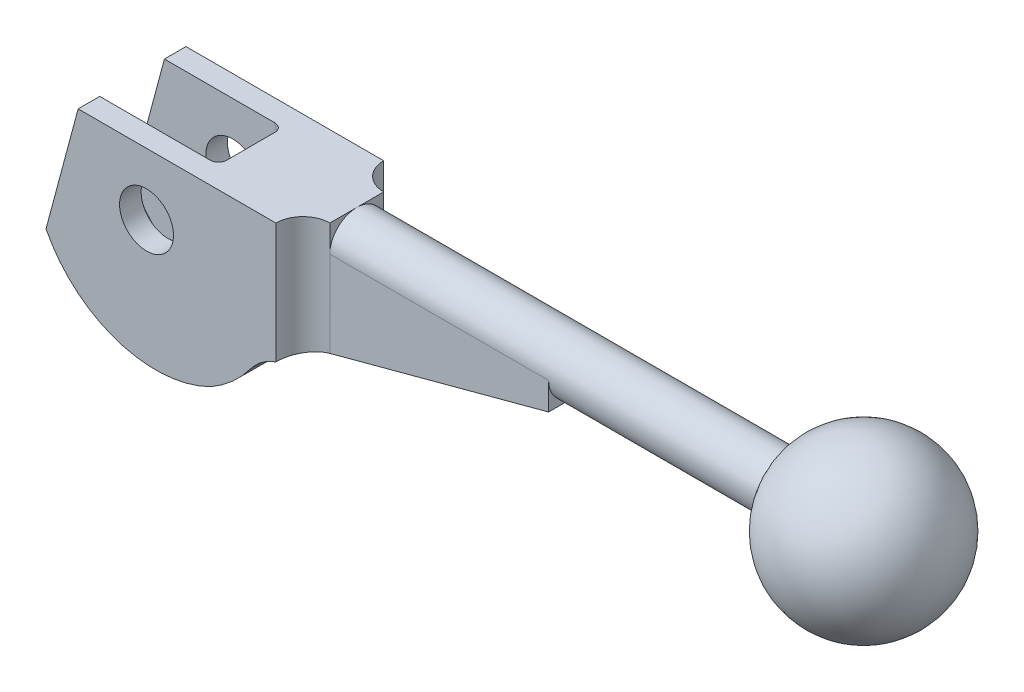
ISO-10303-21;
HEADER;
FILE_DESCRIPTION(('STEP AP214'),'2;1');
FILE_NAME('part.step','',(''),(''),'','','');
FILE_SCHEMA(('AUTOMOTIVE_DESIGN { 1 0 10303 214 1 1 1 1 }'));
ENDSEC;
DATA;
#1=APPLICATION_CONTEXT('core data for automotive mechanical design processes');
#2=APPLICATION_PROTOCOL_DEFINITION('international standard','automotive_design',2000,#1);
#3=PRODUCT_CONTEXT('',#1,'mechanical');
#4=PRODUCT('Part','Part','',(#3));
#5=PRODUCT_RELATED_PRODUCT_CATEGORY('part','',(#4));
#6=PRODUCT_DEFINITION_FORMATION('','',#4);
#7=PRODUCT_DEFINITION_CONTEXT('part definition',#1,'design');
#8=PRODUCT_DEFINITION('design','',#6,#7);
#9=PRODUCT_DEFINITION_SHAPE('','',#8);
#10=(LENGTH_UNIT() NAMED_UNIT(*) SI_UNIT(.MILLI.,.METRE.));
#11=(NAMED_UNIT(*) PLANE_ANGLE_UNIT() SI_UNIT($,.RADIAN.));
#12=(NAMED_UNIT(*) SI_UNIT($,.STERADIAN.) SOLID_ANGLE_UNIT());
#13=UNCERTAINTY_MEASURE_WITH_UNIT(LENGTH_MEASURE(1.E-05),#10,'distance_accuracy_value','');
#14=(GEOMETRIC_REPRESENTATION_CONTEXT(3) GLOBAL_UNCERTAINTY_ASSIGNED_CONTEXT((#13)) GLOBAL_UNIT_ASSIGNED_CONTEXT((#10,
#11,#12)) REPRESENTATION_CONTEXT('',''));
#15=CARTESIAN_POINT('',(0.,0.,0.));
#16=DIRECTION('',(0.,0.,1.));
#17=DIRECTION('',(1.,0.,0.));
#18=AXIS2_PLACEMENT_3D('',#15,#16,#17);
#19=CARTESIAN_POINT('',(0.,0.,10.));
#20=DIRECTION('',(0.,0.,1.));
#21=DIRECTION('',(1.,0.,0.));
#22=AXIS2_PLACEMENT_3D('',#19,#20,#21);
#23=CYLINDRICAL_SURFACE('',#22,5.);
#24=CARTESIAN_POINT('',(0.,0.,-6.));
#25=DIRECTION('',(0.,0.,1.));
#26=DIRECTION('',(1.,0.,0.));
#27=AXIS2_PLACEMENT_3D('',#24,#25,#26);
#28=CIRCLE('',#27,5.);
#29=CARTESIAN_POINT('',(5.,0.,-6.));
#30=VERTEX_POINT('',#29);
#31=EDGE_CURVE('E324',#30,#30,#28,.F.);
#32=ORIENTED_EDGE('',*,*,#31,.F.);
#33=EDGE_LOOP('',(#32));
#34=FACE_BOUND('',#33,.T.);
#35=CARTESIAN_POINT('',(0.,0.,-10.));
#36=DIRECTION('',(0.,0.,1.));
#37=DIRECTION('',(1.,0.,0.));
#38=AXIS2_PLACEMENT_3D('',#35,#36,#37);
#39=CIRCLE('',#38,5.);
#40=CARTESIAN_POINT('',(5.,0.,-10.));
#41=VERTEX_POINT('',#40);
#42=EDGE_CURVE('E17',#41,#41,#39,.F.);
#43=ORIENTED_EDGE('',*,*,#42,.T.);
#44=EDGE_LOOP('',(#43));
#45=FACE_BOUND('',#44,.T.);
#46=ADVANCED_FACE('F14',(#34,#45),#23,.F.);
#47=CARTESIAN_POINT('',(1.7,-0.45,10.));
#48=DIRECTION('',(0.,0.,1.));
#49=DIRECTION('',(1.,0.,0.));
#50=AXIS2_PLACEMENT_3D('',#47,#48,#49);
#51=CYLINDRICAL_SURFACE('',#50,22.8);
#52=CARTESIAN_POINT('',(1.7,-0.449999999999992,-10.));
#53=DIRECTION('',(0.,0.,1.));
#54=DIRECTION('',(1.,0.,0.));
#55=AXIS2_PLACEMENT_3D('',#52,#53,#54);
#56=CIRCLE('',#55,22.8);
#57=CARTESIAN_POINT('',(-18.64,-10.7516697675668,-10.));
#58=VERTEX_POINT('',#57);
#59=CARTESIAN_POINT('',(11.9120166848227,-20.8351591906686,-10.));
#60=VERTEX_POINT('',#59);
#61=EDGE_CURVE('E150',#58,#60,#56,.T.);
#62=ORIENTED_EDGE('',*,*,#61,.T.);
#63=DIRECTION('',(0.,0.,1.));
#64=VECTOR('',#63,1.);
#65=CARTESIAN_POINT('',(11.912016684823,-20.8351591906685,10.));
#66=LINE('',#65,#64);
#67=CARTESIAN_POINT('',(11.9120166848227,-20.8351591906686,-6.));
#68=VERTEX_POINT('',#67);
#69=EDGE_CURVE('E153',#68,#60,#66,.F.);
#70=ORIENTED_EDGE('',*,*,#69,.F.);
#71=CARTESIAN_POINT('',(1.7,-0.449999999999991,-6.));
#72=DIRECTION('',(0.,0.,1.));
#73=DIRECTION('',(1.,0.,0.));
#74=AXIS2_PLACEMENT_3D('',#71,#72,#73);
#75=CIRCLE('',#74,22.8);
#76=CARTESIAN_POINT('',(-18.64,-10.7516697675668,-6.));
#77=VERTEX_POINT('',#76);
#78=EDGE_CURVE('E323',#77,#68,#75,.T.);
#79=ORIENTED_EDGE('',*,*,#78,.F.);
#80=DIRECTION('',(0.,0.,1.));
#81=VECTOR('',#80,1.);
#82=CARTESIAN_POINT('',(-18.64,-10.7516697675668,10.));
#83=LINE('',#82,#81);
#84=EDGE_CURVE('E147',#58,#77,#83,.T.);
#85=ORIENTED_EDGE('',*,*,#84,.F.);
#86=EDGE_LOOP('',(#62,#70,#79,#85));
#87=FACE_BOUND('',#86,.T.);
#88=ADVANCED_FACE('F152',(#87),#51,.T.);
#89=CARTESIAN_POINT('',(0.,0.,10.));
#90=DIRECTION('',(0.,0.,1.));
#91=DIRECTION('',(1.,0.,0.));
#92=AXIS2_PLACEMENT_3D('',#89,#90,#91);
#93=CYLINDRICAL_SURFACE('',#92,5.);
#94=CARTESIAN_POINT('',(0.,0.,6.));
#95=DIRECTION('',(0.,0.,1.));
#96=DIRECTION('',(1.,0.,0.));
#97=AXIS2_PLACEMENT_3D('',#94,#95,#96);
#98=CIRCLE('',#97,5.);
#99=CARTESIAN_POINT('',(5.,0.,6.));
#100=VERTEX_POINT('',#99);
#101=EDGE_CURVE('E175',#100,#100,#98,.T.);
#102=ORIENTED_EDGE('',*,*,#101,.F.);
#103=EDGE_LOOP('',(#102));
#104=FACE_BOUND('',#103,.T.);
#105=CARTESIAN_POINT('',(0.,0.,10.));
#106=DIRECTION('',(0.,0.,1.));
#107=DIRECTION('',(1.,0.,0.));
#108=AXIS2_PLACEMENT_3D('',#105,#106,#107);
#109=CIRCLE('',#108,5.);
#110=CARTESIAN_POINT('',(5.,0.,10.));
#111=VERTEX_POINT('',#110);
#112=EDGE_CURVE('E319',#111,#111,#109,.F.);
#113=ORIENTED_EDGE('',*,*,#112,.F.);
#114=EDGE_LOOP('',(#113));
#115=FACE_BOUND('',#114,.T.);
#116=ADVANCED_FACE('F218',(#104,#115),#93,.F.);
#117=CARTESIAN_POINT('',(1.7,-0.45,10.));
#118=DIRECTION('',(0.,0.,1.));
#119=DIRECTION('',(1.,0.,0.));
#120=AXIS2_PLACEMENT_3D('',#117,#118,#119);
#121=CYLINDRICAL_SURFACE('',#120,22.8);
#122=CARTESIAN_POINT('',(1.7,-0.45,10.));
#123=DIRECTION('',(0.,0.,1.));
#124=DIRECTION('',(1.,0.,0.));
#125=AXIS2_PLACEMENT_3D('',#122,#123,#124);
#126=CIRCLE('',#125,22.8);
#127=CARTESIAN_POINT('',(-18.64,-10.7516697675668,10.));
#128=VERTEX_POINT('',#127);
#129=CARTESIAN_POINT('',(11.9120166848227,-20.8351591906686,10.));
#130=VERTEX_POINT('',#129);
#131=EDGE_CURVE('E314',#128,#130,#126,.T.);
#132=ORIENTED_EDGE('',*,*,#131,.F.);
#133=DIRECTION('',(0.,0.,1.));
#134=VECTOR('',#133,1.);
#135=CARTESIAN_POINT('',(-18.64,-10.7516697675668,10.));
#136=LINE('',#135,#134);
#137=CARTESIAN_POINT('',(-18.64,-10.7516697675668,6.));
#138=VERTEX_POINT('',#137);
#139=EDGE_CURVE('E173',#138,#128,#136,.T.);
#140=ORIENTED_EDGE('',*,*,#139,.F.);
#141=CARTESIAN_POINT('',(1.7,-0.449999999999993,6.));
#142=DIRECTION('',(0.,0.,1.));
#143=DIRECTION('',(1.,0.,0.));
#144=AXIS2_PLACEMENT_3D('',#141,#142,#143);
#145=CIRCLE('',#144,22.8);
#146=CARTESIAN_POINT('',(11.9120166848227,-20.8351591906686,6.));
#147=VERTEX_POINT('',#146);
#148=EDGE_CURVE('E183',#147,#138,#145,.F.);
#149=ORIENTED_EDGE('',*,*,#148,.F.);
#150=DIRECTION('',(0.,0.,1.));
#151=VECTOR('',#150,1.);
#152=CARTESIAN_POINT('',(11.912016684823,-20.8351591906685,10.));
#153=LINE('',#152,#151);
#154=EDGE_CURVE('E166',#130,#147,#153,.F.);
#155=ORIENTED_EDGE('',*,*,#154,.F.);
#156=EDGE_LOOP('',(#132,#140,#149,#155));
#157=FACE_BOUND('',#156,.T.);
#158=ADVANCED_FACE('F213',(#157),#121,.T.);
#159=CARTESIAN_POINT('',(0.,-1.2490009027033E-13,10.));
#160=DIRECTION('',(0.,0.,1.));
#161=DIRECTION('',(1.,0.,0.));
#162=AXIS2_PLACEMENT_3D('',#159,#160,#161);
#163=CYLINDRICAL_SURFACE('',#162,24.);
#164=DIRECTION('',(0.,0.,1.));
#165=VECTOR('',#164,1.);
#166=CARTESIAN_POINT('',(16.9705627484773,-16.9705627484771,4.5));
#167=LINE('',#166,#165);
#168=CARTESIAN_POINT('',(16.9705627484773,-16.9705627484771,-4.5));
#169=VERTEX_POINT('',#168);
#170=CARTESIAN_POINT('',(16.9705627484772,-16.9705627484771,4.5));
#171=VERTEX_POINT('',#170);
#172=EDGE_CURVE('E195',#169,#171,#167,.T.);
#173=ORIENTED_EDGE('',*,*,#172,.F.);
#174=CARTESIAN_POINT('',(16.9705627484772,-16.970562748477,-4.5));
#175=CARTESIAN_POINT('',(16.9705645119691,-16.9705601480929,-4.5383201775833));
#176=CARTESIAN_POINT('',(16.9693628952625,-16.9717626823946,-4.57662008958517));
#177=CARTESIAN_POINT('',(16.9645824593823,-16.9765414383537,-4.65290849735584));
#178=CARTESIAN_POINT('',(16.9610045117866,-16.9801167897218,-4.69089710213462));
#179=CARTESIAN_POINT('',(16.946800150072,-16.9942976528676,-4.80362734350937));
#180=CARTESIAN_POINT('',(16.932702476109,-17.0083588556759,-4.87755009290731));
#181=CARTESIAN_POINT('',(16.8959205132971,-17.0448974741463,-5.02088482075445));
#182=CARTESIAN_POINT('',(16.8732449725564,-17.0673663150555,-5.09030131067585));
#183=CARTESIAN_POINT('',(16.8202222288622,-17.1196234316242,-5.2232446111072));
#184=CARTESIAN_POINT('',(16.7898678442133,-17.1494185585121,-5.28676583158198));
#185=CARTESIAN_POINT('',(16.7206295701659,-17.2169395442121,-5.41011536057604));
#186=CARTESIAN_POINT('',(16.6813609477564,-17.2550181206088,-5.46953285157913));
#187=CARTESIAN_POINT('',(16.5966343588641,-17.3365274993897,-5.57960703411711));
#188=CARTESIAN_POINT('',(16.5511745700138,-17.3799598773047,-5.6302611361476));
#189=CARTESIAN_POINT('',(16.4490875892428,-17.4766429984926,-5.72809301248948));
#190=CARTESIAN_POINT('',(16.3917752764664,-17.5304404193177,-5.7740159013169));
#191=CARTESIAN_POINT('',(16.2721584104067,-17.6415290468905,-5.85352789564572));
#192=CARTESIAN_POINT('',(16.2098502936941,-17.6988227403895,-5.88710810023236));
#193=CARTESIAN_POINT('',(16.0789223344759,-17.8178658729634,-5.94267438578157));
#194=CARTESIAN_POINT('',(16.0101470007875,-17.8797012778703,-5.96411005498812));
#195=CARTESIAN_POINT('',(15.8703289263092,-18.0039336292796,-5.99277119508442));
#196=CARTESIAN_POINT('',(15.7992888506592,-18.0663298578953,-6.00001278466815));
#197=CARTESIAN_POINT('',(15.7278575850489,-18.1282788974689,-6.));
#198=B_SPLINE_CURVE_WITH_KNOTS('',3,(#174,#175,#176,#177,#178,#179,#180,#181,#182,#183,#184,
#185,#186,#187,#188,#189,#190,#191,#192,#193,#194,#195,#196,#197),.UNSPECIFIED.,.F.,.F.,(4,2,2,
2,2,2,2,2,2,2,2,4),(0.,0.114883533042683,0.229724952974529,0.458174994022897,0.686392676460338,
0.914824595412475,1.15615014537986,1.39754688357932,1.6695476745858,1.94174423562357,
2.22545274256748,2.50883888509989),.UNSPECIFIED.);
#199=CARTESIAN_POINT('',(15.7278575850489,-18.1282788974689,-6.));
#200=VERTEX_POINT('',#199);
#201=EDGE_CURVE('E197',#169,#200,#198,.T.);
#202=ORIENTED_EDGE('',*,*,#201,.T.);
#203=CARTESIAN_POINT('',(0.,-1.2490009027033E-13,-6.));
#204=DIRECTION('',(0.,0.,1.));
#205=DIRECTION('',(1.,0.,0.));
#206=AXIS2_PLACEMENT_3D('',#203,#204,#205);
#207=CIRCLE('',#206,24.);
#208=EDGE_CURVE('E164',#68,#200,#207,.T.);
#209=ORIENTED_EDGE('',*,*,#208,.F.);
#210=ORIENTED_EDGE('',*,*,#69,.T.);
#211=CARTESIAN_POINT('',(0.,-1.2490009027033E-13,-10.));
#212=DIRECTION('',(0.,0.,1.));
#213=DIRECTION('',(1.,0.,0.));
#214=AXIS2_PLACEMENT_3D('',#211,#212,#213);
#215=CIRCLE('',#214,24.);
#216=CARTESIAN_POINT('',(19.281919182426,-14.2901222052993,-10.));
#217=VERTEX_POINT('',#216);
#218=EDGE_CURVE('E158',#60,#217,#215,.T.);
#219=ORIENTED_EDGE('',*,*,#218,.T.);
#220=DIRECTION('',(0.,0.,1.));
#221=VECTOR('',#220,1.);
#222=CARTESIAN_POINT('',(19.2819191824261,-14.2901222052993,10.));
#223=LINE('',#222,#221);
#224=CARTESIAN_POINT('',(19.2819191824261,-14.2901222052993,10.));
#225=VERTEX_POINT('',#224);
#226=EDGE_CURVE('E339',#217,#225,#223,.T.);
#227=ORIENTED_EDGE('',*,*,#226,.T.);
#228=CARTESIAN_POINT('',(0.,-1.2490009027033E-13,10.));
#229=DIRECTION('',(0.,0.,1.));
#230=DIRECTION('',(1.,0.,0.));
#231=AXIS2_PLACEMENT_3D('',#228,#229,#230);
#232=CIRCLE('',#231,24.);
#233=EDGE_CURVE('E315',#130,#225,#232,.T.);
#234=ORIENTED_EDGE('',*,*,#233,.F.);
#235=ORIENTED_EDGE('',*,*,#154,.T.);
#236=CARTESIAN_POINT('',(0.,-1.2490009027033E-13,6.));
#237=DIRECTION('',(0.,0.,1.));
#238=DIRECTION('',(1.,0.,0.));
#239=AXIS2_PLACEMENT_3D('',#236,#237,#238);
#240=CIRCLE('',#239,24.);
#241=CARTESIAN_POINT('',(15.7278575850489,-18.1282788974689,6.));
#242=VERTEX_POINT('',#241);
#243=EDGE_CURVE('E180',#242,#147,#240,.F.);
#244=ORIENTED_EDGE('',*,*,#243,.F.);
#245=CARTESIAN_POINT('',(15.7278575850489,-18.1282788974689,6.));
#246=CARTESIAN_POINT('',(15.8064811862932,-18.060100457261,6.00001560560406));
#247=CARTESIAN_POINT('',(15.8846217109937,-17.9913772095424,5.99124233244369));
#248=CARTESIAN_POINT('',(16.0380390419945,-17.8547345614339,5.95654574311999));
#249=CARTESIAN_POINT('',(16.113309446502,-17.7868171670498,5.93058621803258));
#250=CARTESIAN_POINT('',(16.2587987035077,-17.6539307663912,5.86192052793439));
#251=CARTESIAN_POINT('',(16.329013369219,-17.5889642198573,5.81920066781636));
#252=CARTESIAN_POINT('',(16.4621696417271,-17.4643996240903,5.71764905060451));
#253=CARTESIAN_POINT('',(16.5251159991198,-17.4047980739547,5.65882790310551));
#254=CARTESIAN_POINT('',(16.6388681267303,-17.2960688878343,5.52896242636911));
#255=CARTESIAN_POINT('',(16.6900883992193,-17.2465940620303,5.45857556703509));
#256=CARTESIAN_POINT('',(16.7815351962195,-17.1576268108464,5.30534836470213));
#257=CARTESIAN_POINT('',(16.8217684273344,-17.1181282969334,5.2225156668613));
#258=CARTESIAN_POINT('',(16.8847750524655,-17.0559694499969,5.0577788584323));
#259=CARTESIAN_POINT('',(16.9090897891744,-17.0318332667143,4.97702008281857));
#260=CARTESIAN_POINT('',(16.9460897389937,-16.9950211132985,4.81048623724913));
#261=CARTESIAN_POINT('',(16.9588085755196,-16.9823120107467,4.72472644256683));
#262=CARTESIAN_POINT('',(16.9670902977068,-16.9740344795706,4.61523347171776));
#263=CARTESIAN_POINT('',(16.9683925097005,-16.9727326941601,4.5922096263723));
#264=CARTESIAN_POINT('',(16.9701273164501,-16.9709982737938,4.54612766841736));
#265=CARTESIAN_POINT('',(16.9705610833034,-16.9705644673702,4.52306964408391));
#266=CARTESIAN_POINT('',(16.9705627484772,-16.970562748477,4.5));
#267=B_SPLINE_CURVE_WITH_KNOTS('',3,(#245,#246,#247,#248,#249,#250,#251,#252,#253,#254,#255,
#256,#257,#258,#259,#260,#261,#262,#263,#264,#265,#266),.UNSPECIFIED.,.F.,.F.,(4,2,2,2,2,2,2,2,
2,2,4),(0.,0.311831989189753,0.624323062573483,0.937070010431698,1.24961137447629,
1.54829735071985,1.84680059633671,2.1084902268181,2.3694186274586,2.43868977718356,
2.50786737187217),.UNSPECIFIED.);
#268=EDGE_CURVE('E187',#242,#171,#267,.T.);
#269=ORIENTED_EDGE('',*,*,#268,.T.);
#270=EDGE_LOOP('',(#173,#202,#209,#210,#219,#227,#234,#235,#244,#269));
#271=FACE_BOUND('',#270,.T.);
#272=ADVANCED_FACE('F161',(#271),#163,.T.);
#273=CARTESIAN_POINT('',(-18.64,-10.7516697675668,10.));
#274=DIRECTION('',(-0.965925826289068,0.258819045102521,0.));
#275=DIRECTION('',(-0.258819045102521,-0.965925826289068,0.));
#276=AXIS2_PLACEMENT_3D('',#273,#274,#275);
#277=PLANE('',#276);
#278=DIRECTION('',(0.,0.,-1.));
#279=VECTOR('',#278,1.);
#280=CARTESIAN_POINT('',(-12.6776830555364,11.5,10.));
#281=LINE('',#280,#279);
#282=CARTESIAN_POINT('',(-12.6776830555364,11.5,-6.));
#283=VERTEX_POINT('',#282);
#284=CARTESIAN_POINT('',(-12.6776830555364,11.5,-10.));
#285=VERTEX_POINT('',#284);
#286=EDGE_CURVE('E299',#283,#285,#281,.T.);
#287=ORIENTED_EDGE('',*,*,#286,.T.);
#288=DIRECTION('',(-0.258819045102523,-0.965925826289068,0.));
#289=VECTOR('',#288,1.);
#290=CARTESIAN_POINT('',(-12.6776830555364,11.5,-10.));
#291=LINE('',#290,#289);
#292=EDGE_CURVE('E159',#285,#58,#291,.T.);
#293=ORIENTED_EDGE('',*,*,#292,.T.);
#294=ORIENTED_EDGE('',*,*,#84,.T.);
#295=DIRECTION('',(-0.258819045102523,-0.965925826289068,0.));
#296=VECTOR('',#295,1.);
#297=CARTESIAN_POINT('',(-12.6776830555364,11.5,-6.));
#298=LINE('',#297,#296);
#299=EDGE_CURVE('E320',#283,#77,#298,.T.);
#300=ORIENTED_EDGE('',*,*,#299,.F.);
#301=EDGE_LOOP('',(#287,#293,#294,#300));
#302=FACE_BOUND('',#301,.T.);
#303=ADVANCED_FACE('F212',(#302),#277,.T.);
#304=CARTESIAN_POINT('',(0.,0.,-10.));
#305=DIRECTION('',(0.,0.,1.));
#306=DIRECTION('',(1.,0.,0.));
#307=AXIS2_PLACEMENT_3D('',#304,#305,#306);
#308=PLANE('',#307);
#309=ORIENTED_EDGE('',*,*,#218,.F.);
#310=ORIENTED_EDGE('',*,*,#61,.F.);
#311=ORIENTED_EDGE('',*,*,#292,.F.);
#312=DIRECTION('',(1.,0.,0.));
#313=VECTOR('',#312,1.);
#314=CARTESIAN_POINT('',(31.,11.5,-10.));
#315=LINE('',#314,#313);
#316=CARTESIAN_POINT('',(24.,11.5,-10.));
#317=VERTEX_POINT('',#316);
#318=EDGE_CURVE('E297',#285,#317,#315,.T.);
#319=ORIENTED_EDGE('',*,*,#318,.T.);
#320=DIRECTION('',(0.,1.,0.));
#321=VECTOR('',#320,1.);
#322=CARTESIAN_POINT('',(24.,21.5,-10.));
#323=LINE('',#322,#321);
#324=CARTESIAN_POINT('',(24.,-10.8101573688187,-10.));
#325=VERTEX_POINT('',#324);
#326=EDGE_CURVE('E300',#317,#325,#323,.F.);
#327=ORIENTED_EDGE('',*,*,#326,.T.);
#328=CARTESIAN_POINT('',(27.3160521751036,-20.2443397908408,-10.));
#329=DIRECTION('',(0.,0.,1.));
#330=DIRECTION('',(1.,0.,0.));
#331=AXIS2_PLACEMENT_3D('',#328,#329,#330);
#332=CIRCLE('',#331,10.);
#333=EDGE_CURVE('E171',#325,#217,#332,.T.);
#334=ORIENTED_EDGE('',*,*,#333,.T.);
#335=EDGE_LOOP('',(#309,#310,#311,#319,#327,#334));
#336=FACE_BOUND('',#335,.T.);
#337=ORIENTED_EDGE('',*,*,#42,.F.);
#338=EDGE_LOOP('',(#337));
#339=FACE_BOUND('',#338,.T.);
#340=ADVANCED_FACE('F168',(#336,#339),#308,.F.);
#341=CARTESIAN_POINT('',(-18.64,-10.7516697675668,10.));
#342=DIRECTION('',(-0.965925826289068,0.258819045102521,0.));
#343=DIRECTION('',(-0.258819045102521,-0.965925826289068,0.));
#344=AXIS2_PLACEMENT_3D('',#341,#342,#343);
#345=PLANE('',#344);
#346=ORIENTED_EDGE('',*,*,#139,.T.);
#347=DIRECTION('',(-0.258819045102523,-0.965925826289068,0.));
#348=VECTOR('',#347,1.);
#349=CARTESIAN_POINT('',(-12.6776830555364,11.5,10.));
#350=LINE('',#349,#348);
#351=CARTESIAN_POINT('',(-12.6776830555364,11.5,10.));
#352=VERTEX_POINT('',#351);
#353=EDGE_CURVE('E311',#352,#128,#350,.T.);
#354=ORIENTED_EDGE('',*,*,#353,.F.);
#355=DIRECTION('',(0.,0.,-1.));
#356=VECTOR('',#355,1.);
#357=CARTESIAN_POINT('',(-12.6776830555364,11.5,10.));
#358=LINE('',#357,#356);
#359=CARTESIAN_POINT('',(-12.6776830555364,11.5,6.));
#360=VERTEX_POINT('',#359);
#361=EDGE_CURVE('E292',#352,#360,#358,.T.);
#362=ORIENTED_EDGE('',*,*,#361,.T.);
#363=DIRECTION('',(0.258819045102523,0.965925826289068,0.));
#364=VECTOR('',#363,1.);
#365=CARTESIAN_POINT('',(-18.64,-10.7516697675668,6.));
#366=LINE('',#365,#364);
#367=EDGE_CURVE('E186',#138,#360,#366,.T.);
#368=ORIENTED_EDGE('',*,*,#367,.F.);
#369=EDGE_LOOP('',(#346,#354,#362,#368));
#370=FACE_BOUND('',#369,.T.);
#371=ADVANCED_FACE('F534',(#370),#345,.T.);
#372=CARTESIAN_POINT('',(-139.052509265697,90.0799626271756,6.));
#373=DIRECTION('',(0.,0.,-1.));
#374=DIRECTION('',(-1.,0.,0.));
#375=AXIS2_PLACEMENT_3D('',#372,#373,#374);
#376=PLANE('',#375);
#377=ORIENTED_EDGE('',*,*,#148,.T.);
#378=ORIENTED_EDGE('',*,*,#367,.T.);
#379=DIRECTION('',(1.,0.,0.));
#380=VECTOR('',#379,1.);
#381=CARTESIAN_POINT('',(31.,11.5,6.));
#382=LINE('',#381,#380);
#383=CARTESIAN_POINT('',(7.78898418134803,11.5,6.));
#384=VERTEX_POINT('',#383);
#385=EDGE_CURVE('E290',#360,#384,#382,.T.);
#386=ORIENTED_EDGE('',*,*,#385,.T.);
#387=DIRECTION('',(-0.258819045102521,0.965925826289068,0.));
#388=VECTOR('',#387,1.);
#389=CARTESIAN_POINT('',(-21.6925213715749,121.526476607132,6.));
#390=LINE('',#389,#388);
#391=EDGE_CURVE('E196',#384,#242,#390,.F.);
#392=ORIENTED_EDGE('',*,*,#391,.T.);
#393=ORIENTED_EDGE('',*,*,#243,.T.);
#394=EDGE_LOOP('',(#377,#378,#386,#392,#393));
#395=FACE_BOUND('',#394,.T.);
#396=ORIENTED_EDGE('',*,*,#101,.T.);
#397=EDGE_LOOP('',(#396));
#398=FACE_BOUND('',#397,.T.);
#399=ADVANCED_FACE('F527',(#395,#398),#376,.T.);
#400=CARTESIAN_POINT('',(-21.6925213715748,121.526476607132,4.5));
#401=DIRECTION('',(-0.258819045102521,0.965925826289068,0.));
#402=DIRECTION('',(-0.965925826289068,-0.258819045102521,0.));
#403=AXIS2_PLACEMENT_3D('',#400,#401,#402);
#404=CYLINDRICAL_SURFACE('',#403,1.5);
#405=DIRECTION('',(0.258819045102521,-0.965925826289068,0.));
#406=VECTOR('',#405,1.);
#407=CARTESIAN_POINT('',(-20.2436326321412,121.914705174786,4.5));
#408=LINE('',#407,#406);
#409=CARTESIAN_POINT('',(9.34189845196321,11.5,4.5));
#410=VERTEX_POINT('',#409);
#411=EDGE_CURVE('E330',#171,#410,#408,.F.);
#412=ORIENTED_EDGE('',*,*,#411,.F.);
#413=ORIENTED_EDGE('',*,*,#268,.F.);
#414=ORIENTED_EDGE('',*,*,#391,.F.);
#415=CARTESIAN_POINT('',(7.78898418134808,11.5,4.5));
#416=DIRECTION('',(0.,-1.,0.));
#417=DIRECTION('',(-1.,0.,0.));
#418=AXIS2_PLACEMENT_3D('',#415,#416,#417);
#419=ELLIPSE('',#418,1.55291427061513,1.5);
#420=EDGE_CURVE('E289',#384,#410,#419,.F.);
#421=ORIENTED_EDGE('',*,*,#420,.T.);
#422=EDGE_LOOP('',(#412,#413,#414,#421));
#423=FACE_BOUND('',#422,.T.);
#424=ADVANCED_FACE('F204',(#423),#404,.F.);
#425=CARTESIAN_POINT('',(-20.2436326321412,121.914705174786,4.5));
#426=DIRECTION('',(-0.965925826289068,-0.258819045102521,0.));
#427=DIRECTION('',(0.258819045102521,-0.965925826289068,0.));
#428=AXIS2_PLACEMENT_3D('',#425,#426,#427);
#429=PLANE('',#428);
#430=ORIENTED_EDGE('',*,*,#172,.T.);
#431=ORIENTED_EDGE('',*,*,#411,.T.);
#432=DIRECTION('',(0.,0.,-1.));
#433=VECTOR('',#432,1.);
#434=CARTESIAN_POINT('',(9.34189845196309,11.5,10.));
#435=LINE('',#434,#433);
#436=CARTESIAN_POINT('',(9.34189845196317,11.5,-4.5));
#437=VERTEX_POINT('',#436);
#438=EDGE_CURVE('E287',#410,#437,#435,.T.);
#439=ORIENTED_EDGE('',*,*,#438,.T.);
#440=DIRECTION('',(-0.258819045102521,0.965925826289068,0.));
#441=VECTOR('',#440,1.);
#442=CARTESIAN_POINT('',(-20.2436326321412,121.914705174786,-4.5));
#443=LINE('',#442,#441);
#444=EDGE_CURVE('E327',#437,#169,#443,.F.);
#445=ORIENTED_EDGE('',*,*,#444,.T.);
#446=EDGE_LOOP('',(#430,#431,#439,#445));
#447=FACE_BOUND('',#446,.T.);
#448=ADVANCED_FACE('F515',(#447),#429,.T.);
#449=CARTESIAN_POINT('',(-21.6925213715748,121.526476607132,-4.5));
#450=DIRECTION('',(-0.258819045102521,0.965925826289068,0.));
#451=DIRECTION('',(-0.965925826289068,-0.258819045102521,0.));
#452=AXIS2_PLACEMENT_3D('',#449,#450,#451);
#453=CYLINDRICAL_SURFACE('',#452,1.5);
#454=DIRECTION('',(-0.258819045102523,0.965925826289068,0.));
#455=VECTOR('',#454,1.);
#456=CARTESIAN_POINT('',(15.727857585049,-18.128278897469,-6.));
#457=LINE('',#456,#455);
#458=CARTESIAN_POINT('',(7.78898418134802,11.5,-6.));
#459=VERTEX_POINT('',#458);
#460=EDGE_CURVE('E316',#200,#459,#457,.T.);
#461=ORIENTED_EDGE('',*,*,#460,.F.);
#462=ORIENTED_EDGE('',*,*,#201,.F.);
#463=ORIENTED_EDGE('',*,*,#444,.F.);
#464=CARTESIAN_POINT('',(7.78898418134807,11.5,-4.5));
#465=DIRECTION('',(0.,-1.,0.));
#466=DIRECTION('',(-1.,0.,0.));
#467=AXIS2_PLACEMENT_3D('',#464,#465,#466);
#468=ELLIPSE('',#467,1.55291427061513,1.5);
#469=EDGE_CURVE('E286',#437,#459,#468,.F.);
#470=ORIENTED_EDGE('',*,*,#469,.T.);
#471=EDGE_LOOP('',(#461,#462,#463,#470));
#472=FACE_BOUND('',#471,.T.);
#473=ADVANCED_FACE('F412',(#472),#453,.F.);
#474=CARTESIAN_POINT('',(-21.6925213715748,121.526476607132,-6.));
#475=DIRECTION('',(0.,0.,1.));
#476=DIRECTION('',(1.,0.,0.));
#477=AXIS2_PLACEMENT_3D('',#474,#475,#476);
#478=PLANE('',#477);
#479=ORIENTED_EDGE('',*,*,#208,.T.);
#480=ORIENTED_EDGE('',*,*,#460,.T.);
#481=DIRECTION('',(1.,0.,0.));
#482=VECTOR('',#481,1.);
#483=CARTESIAN_POINT('',(31.,11.5,-6.));
#484=LINE('',#483,#482);
#485=EDGE_CURVE('E283',#459,#283,#484,.F.);
#486=ORIENTED_EDGE('',*,*,#485,.T.);
#487=ORIENTED_EDGE('',*,*,#299,.T.);
#488=ORIENTED_EDGE('',*,*,#78,.T.);
#489=EDGE_LOOP('',(#479,#480,#486,#487,#488));
#490=FACE_BOUND('',#489,.T.);
#491=ORIENTED_EDGE('',*,*,#31,.T.);
#492=EDGE_LOOP('',(#491));
#493=FACE_BOUND('',#492,.T.);
#494=ADVANCED_FACE('F416',(#490,#493),#478,.T.);
#495=CARTESIAN_POINT('',(0.,0.,10.));
#496=DIRECTION('',(0.,0.,1.));
#497=DIRECTION('',(1.,0.,0.));
#498=AXIS2_PLACEMENT_3D('',#495,#496,#497);
#499=PLANE('',#498);
#500=ORIENTED_EDGE('',*,*,#353,.T.);
#501=ORIENTED_EDGE('',*,*,#131,.T.);
#502=ORIENTED_EDGE('',*,*,#233,.T.);
#503=CARTESIAN_POINT('',(27.3160521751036,-20.2443397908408,10.));
#504=DIRECTION('',(0.,0.,1.));
#505=DIRECTION('',(1.,0.,0.));
#506=AXIS2_PLACEMENT_3D('',#503,#504,#505);
#507=CIRCLE('',#506,10.);
#508=CARTESIAN_POINT('',(24.,-10.8101573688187,10.));
#509=VERTEX_POINT('',#508);
#510=EDGE_CURVE('E306',#225,#509,#507,.F.);
#511=ORIENTED_EDGE('',*,*,#510,.T.);
#512=DIRECTION('',(0.,1.,0.));
#513=VECTOR('',#512,1.);
#514=CARTESIAN_POINT('',(24.,21.5,10.));
#515=LINE('',#514,#513);
#516=CARTESIAN_POINT('',(24.,11.5,10.));
#517=VERTEX_POINT('',#516);
#518=EDGE_CURVE('E280',#509,#517,#515,.T.);
#519=ORIENTED_EDGE('',*,*,#518,.T.);
#520=DIRECTION('',(1.,0.,0.));
#521=VECTOR('',#520,1.);
#522=CARTESIAN_POINT('',(31.,11.5,10.));
#523=LINE('',#522,#521);
#524=EDGE_CURVE('E293',#517,#352,#523,.F.);
#525=ORIENTED_EDGE('',*,*,#524,.T.);
#526=EDGE_LOOP('',(#500,#501,#502,#511,#519,#525));
#527=FACE_BOUND('',#526,.T.);
#528=ORIENTED_EDGE('',*,*,#112,.T.);
#529=EDGE_LOOP('',(#528));
#530=FACE_BOUND('',#529,.T.);
#531=ADVANCED_FACE('F497',(#527,#530),#499,.T.);
#532=CARTESIAN_POINT('',(27.3160521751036,-20.2443397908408,10.));
#533=DIRECTION('',(0.,0.,1.));
#534=DIRECTION('',(1.,0.,0.));
#535=AXIS2_PLACEMENT_3D('',#532,#533,#534);
#536=CYLINDRICAL_SURFACE('',#535,10.);
#537=CARTESIAN_POINT('',(24.7278617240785,-10.5850815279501,7.40214808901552));
#538=CARTESIAN_POINT('',(24.6564321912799,-10.6042295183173,7.51959507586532));
#539=CARTESIAN_POINT('',(24.5898239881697,-10.6229186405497,7.64006012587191));
#540=CARTESIAN_POINT('',(24.4666452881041,-10.6586712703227,7.88632185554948));
#541=CARTESIAN_POINT('',(24.4100797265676,-10.67573397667,8.01212111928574));
#542=CARTESIAN_POINT('',(24.308651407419,-10.7071344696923,8.26523753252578));
#543=CARTESIAN_POINT('',(24.2635460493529,-10.7215266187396,8.39245050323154));
#544=CARTESIAN_POINT('',(24.1837218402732,-10.7474842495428,8.65030259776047));
#545=CARTESIAN_POINT('',(24.1489987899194,-10.7590508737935,8.78094031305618));
#546=CARTESIAN_POINT('',(24.0802856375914,-10.7822271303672,9.08946418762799));
#547=CARTESIAN_POINT('',(24.0504974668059,-10.7925339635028,9.26841727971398));
#548=CARTESIAN_POINT('',(24.0203519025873,-10.8030232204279,9.53999915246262));
#549=CARTESIAN_POINT('',(24.0127252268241,-10.8056919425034,9.6317933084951));
#550=CARTESIAN_POINT('',(24.0025486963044,-10.8092610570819,9.81571672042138));
#551=CARTESIAN_POINT('',(23.9999999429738,-10.8101610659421,9.90784604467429));
#552=CARTESIAN_POINT('',(24.,-10.8101573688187,10.));
#553=B_SPLINE_CURVE_WITH_KNOTS('',3,(#537,#538,#539,#540,#541,#542,#543,#544,#545,#546,#547,
#548,#549,#550,#551,#552),.UNSPECIFIED.,.F.,.F.,(4,2,2,2,2,2,2,4),(0.,0.416267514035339,
0.832739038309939,1.23947764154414,1.64605150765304,2.18983376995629,2.46614735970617,
2.74252087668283),.UNSPECIFIED.);
#554=CARTESIAN_POINT('',(24.7278617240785,-10.58508152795,7.40214808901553));
#555=VERTEX_POINT('',#554);
#556=EDGE_CURVE('E279',#555,#509,#553,.T.);
#557=ORIENTED_EDGE('',*,*,#556,.T.);
#558=ORIENTED_EDGE('',*,*,#510,.F.);
#559=ORIENTED_EDGE('',*,*,#226,.F.);
#560=ORIENTED_EDGE('',*,*,#333,.F.);
#561=CARTESIAN_POINT('',(24.,-10.8101573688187,-10.));
#562=CARTESIAN_POINT('',(23.9999798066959,-10.8101891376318,-9.86124900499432));
#563=CARTESIAN_POINT('',(24.0057747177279,-10.8081282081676,-9.72250840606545));
#564=CARTESIAN_POINT('',(24.0288447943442,-10.8000536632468,-9.44611217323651));
#565=CARTESIAN_POINT('',(24.0461188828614,-10.7940404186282,-9.3084564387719));
#566=CARTESIAN_POINT('',(24.0914710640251,-10.7784745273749,-9.03840187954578));
#567=CARTESIAN_POINT('',(24.1192921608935,-10.7690062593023,-8.90595490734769));
#568=CARTESIAN_POINT('',(24.1854792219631,-10.7469334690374,-8.64403650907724));
#569=CARTESIAN_POINT('',(24.2238427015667,-10.7343296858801,-8.51456438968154));
#570=CARTESIAN_POINT('',(24.3255815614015,-10.7017577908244,-8.21607891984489));
#571=CARTESIAN_POINT('',(24.393026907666,-10.6807419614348,-8.04855444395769));
#572=CARTESIAN_POINT('',(24.5465781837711,-10.6351587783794,-7.71951271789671));
#573=CARTESIAN_POINT('',(24.6329615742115,-10.6105406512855,-7.55813183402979));
#574=CARTESIAN_POINT('',(24.7278617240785,-10.5850815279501,-7.40214808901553));
#575=B_SPLINE_CURVE_WITH_KNOTS('',3,(#561,#562,#563,#564,#565,#566,#567,#568,#569,#570,#571,
#572,#573,#574),.UNSPECIFIED.,.F.,.F.,(4,2,2,2,2,2,4),(0.,0.416100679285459,0.832162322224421,
1.23867730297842,1.6450965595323,2.18941220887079,2.74231027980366),.UNSPECIFIED.);
#576=CARTESIAN_POINT('',(24.7278617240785,-10.5850815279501,-7.40214808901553));
#577=VERTEX_POINT('',#576);
#578=EDGE_CURVE('E302',#325,#577,#575,.T.);
#579=ORIENTED_EDGE('',*,*,#578,.T.);
#580=DIRECTION('',(0.,0.,1.));
#581=VECTOR('',#580,1.);
#582=CARTESIAN_POINT('',(24.7278617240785,-10.58508152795,10.));
#583=LINE('',#582,#581);
#584=EDGE_CURVE('E303',#555,#577,#583,.F.);
#585=ORIENTED_EDGE('',*,*,#584,.F.);
#586=EDGE_LOOP('',(#557,#558,#559,#560,#579,#585));
#587=FACE_BOUND('',#586,.T.);
#588=ADVANCED_FACE('F367',(#587),#536,.F.);
#589=CARTESIAN_POINT('',(69.83,1.5,10.));
#590=DIRECTION('',(0.258819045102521,-0.965925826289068,0.));
#591=DIRECTION('',(0.965925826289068,0.258819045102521,0.));
#592=AXIS2_PLACEMENT_3D('',#589,#590,#591);
#593=PLANE('',#592);
#594=ORIENTED_EDGE('',*,*,#584,.T.);
#595=CARTESIAN_POINT('',(29.,-9.44036552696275,-10.));
#596=DIRECTION('',(0.258819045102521,-0.965925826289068,0.));
#597=DIRECTION('',(0.965925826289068,0.258819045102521,0.));
#598=AXIS2_PLACEMENT_3D('',#595,#596,#597);
#599=ELLIPSE('',#598,5.17638090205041,5.);
#600=CARTESIAN_POINT('',(29.,-9.44036552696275,-5.));
#601=VERTEX_POINT('',#600);
#602=EDGE_CURVE('E326',#577,#601,#599,.F.);
#603=ORIENTED_EDGE('',*,*,#602,.T.);
#604=DIRECTION('',(0.965925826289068,0.258819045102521,0.));
#605=VECTOR('',#604,1.);
#606=CARTESIAN_POINT('',(29.,-9.44036552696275,-5.));
#607=LINE('',#606,#605);
#608=CARTESIAN_POINT('',(69.58,1.43301270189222,-5.));
#609=VERTEX_POINT('',#608);
#610=EDGE_CURVE('E261',#601,#609,#607,.T.);
#611=ORIENTED_EDGE('',*,*,#610,.T.);
#612=DIRECTION('',(0.,0.,-1.));
#613=VECTOR('',#612,1.);
#614=CARTESIAN_POINT('',(69.58,1.43301270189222,0.));
#615=LINE('',#614,#613);
#616=CARTESIAN_POINT('',(69.58,1.43301270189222,5.));
#617=VERTEX_POINT('',#616);
#618=EDGE_CURVE('E271',#617,#609,#615,.T.);
#619=ORIENTED_EDGE('',*,*,#618,.F.);
#620=DIRECTION('',(0.965925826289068,0.258819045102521,0.));
#621=VECTOR('',#620,1.);
#622=CARTESIAN_POINT('',(29.,-9.44036552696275,5.));
#623=LINE('',#622,#621);
#624=CARTESIAN_POINT('',(29.,-9.44036552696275,5.));
#625=VERTEX_POINT('',#624);
#626=EDGE_CURVE('E275',#625,#617,#623,.T.);
#627=ORIENTED_EDGE('',*,*,#626,.F.);
#628=CARTESIAN_POINT('',(29.,-9.44036552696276,10.));
#629=DIRECTION('',(0.258819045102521,-0.965925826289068,0.));
#630=DIRECTION('',(0.965925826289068,0.258819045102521,0.));
#631=AXIS2_PLACEMENT_3D('',#628,#629,#630);
#632=ELLIPSE('',#631,5.17638090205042,5.);
#633=EDGE_CURVE('E365',#625,#555,#632,.F.);
#634=ORIENTED_EDGE('',*,*,#633,.T.);
#635=EDGE_LOOP('',(#594,#603,#611,#619,#627,#634));
#636=FACE_BOUND('',#635,.T.);
#637=ADVANCED_FACE('F386',(#636),#593,.T.);
#638=CARTESIAN_POINT('',(29.,21.5,-10.));
#639=DIRECTION('',(0.,1.,0.));
#640=DIRECTION('',(0.,0.,1.));
#641=AXIS2_PLACEMENT_3D('',#638,#639,#640);
#642=CYLINDRICAL_SURFACE('',#641,5.);
#643=ORIENTED_EDGE('',*,*,#602,.F.);
#644=ORIENTED_EDGE('',*,*,#578,.F.);
#645=ORIENTED_EDGE('',*,*,#326,.F.);
#646=CARTESIAN_POINT('',(29.,11.5,-10.));
#647=DIRECTION('',(0.,1.,0.));
#648=DIRECTION('',(0.,0.,1.));
#649=AXIS2_PLACEMENT_3D('',#646,#647,#648);
#650=CIRCLE('',#649,5.);
#651=CARTESIAN_POINT('',(29.,11.5,-5.));
#652=VERTEX_POINT('',#651);
#653=EDGE_CURVE('E296',#317,#652,#650,.T.);
#654=ORIENTED_EDGE('',*,*,#653,.T.);
#655=DIRECTION('',(0.,1.,0.));
#656=VECTOR('',#655,1.);
#657=CARTESIAN_POINT('',(29.,6.5,-5.));
#658=LINE('',#657,#656);
#659=CARTESIAN_POINT('',(29.,6.5,-5.));
#660=VERTEX_POINT('',#659);
#661=EDGE_CURVE('E258',#660,#652,#658,.T.);
#662=ORIENTED_EDGE('',*,*,#661,.F.);
#663=DIRECTION('',(0.,1.,0.));
#664=VECTOR('',#663,1.);
#665=CARTESIAN_POINT('',(29.,2.23432383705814E-12,-5.));
#666=LINE('',#665,#664);
#667=EDGE_CURVE('E266',#660,#601,#666,.F.);
#668=ORIENTED_EDGE('',*,*,#667,.T.);
#669=EDGE_LOOP('',(#643,#644,#645,#654,#662,#668));
#670=FACE_BOUND('',#669,.T.);
#671=ADVANCED_FACE('F382',(#670),#642,.F.);
#672=CARTESIAN_POINT('',(31.,11.5,10.));
#673=DIRECTION('',(0.,-1.,0.));
#674=DIRECTION('',(0.,0.,-1.));
#675=AXIS2_PLACEMENT_3D('',#672,#673,#674);
#676=PLANE('',#675);
#677=ORIENTED_EDGE('',*,*,#469,.F.);
#678=ORIENTED_EDGE('',*,*,#438,.F.);
#679=ORIENTED_EDGE('',*,*,#420,.F.);
#680=ORIENTED_EDGE('',*,*,#385,.F.);
#681=ORIENTED_EDGE('',*,*,#361,.F.);
#682=ORIENTED_EDGE('',*,*,#524,.F.);
#683=CARTESIAN_POINT('',(29.,11.5,9.99999999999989));
#684=DIRECTION('',(0.,1.,0.));
#685=DIRECTION('',(0.,0.,1.));
#686=AXIS2_PLACEMENT_3D('',#683,#684,#685);
#687=CIRCLE('',#686,5.);
#688=CARTESIAN_POINT('',(29.,11.5,5.));
#689=VERTEX_POINT('',#688);
#690=EDGE_CURVE('E282',#517,#689,#687,.F.);
#691=ORIENTED_EDGE('',*,*,#690,.T.);
#692=DIRECTION('',(0.,0.,-1.));
#693=VECTOR('',#692,1.);
#694=CARTESIAN_POINT('',(29.,11.5,0.));
#695=LINE('',#694,#693);
#696=CARTESIAN_POINT('',(29.,11.5,0.));
#697=VERTEX_POINT('',#696);
#698=EDGE_CURVE('E249',#697,#689,#695,.F.);
#699=ORIENTED_EDGE('',*,*,#698,.F.);
#700=DIRECTION('',(0.,0.,-1.));
#701=VECTOR('',#700,1.);
#702=CARTESIAN_POINT('',(29.,11.5,0.));
#703=LINE('',#702,#701);
#704=EDGE_CURVE('E252',#652,#697,#703,.F.);
#705=ORIENTED_EDGE('',*,*,#704,.F.);
#706=ORIENTED_EDGE('',*,*,#653,.F.);
#707=ORIENTED_EDGE('',*,*,#318,.F.);
#708=ORIENTED_EDGE('',*,*,#286,.F.);
#709=ORIENTED_EDGE('',*,*,#485,.F.);
#710=EDGE_LOOP('',(#677,#678,#679,#680,#681,#682,#691,#699,#705,#706,#707,#708,#709));
#711=FACE_BOUND('',#710,.T.);
#712=ADVANCED_FACE('F377',(#711),#676,.F.);
#713=CARTESIAN_POINT('',(29.,21.5,10.));
#714=DIRECTION('',(0.,1.,0.));
#715=DIRECTION('',(0.,0.,1.));
#716=AXIS2_PLACEMENT_3D('',#713,#714,#715);
#717=CYLINDRICAL_SURFACE('',#716,5.);
#718=ORIENTED_EDGE('',*,*,#633,.F.);
#719=DIRECTION('',(0.,1.,0.));
#720=VECTOR('',#719,1.);
#721=CARTESIAN_POINT('',(29.,2.23432383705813E-12,5.));
#722=LINE('',#721,#720);
#723=CARTESIAN_POINT('',(29.,6.5,5.));
#724=VERTEX_POINT('',#723);
#725=EDGE_CURVE('E276',#724,#625,#722,.F.);
#726=ORIENTED_EDGE('',*,*,#725,.F.);
#727=DIRECTION('',(0.,1.,0.));
#728=VECTOR('',#727,1.);
#729=CARTESIAN_POINT('',(29.,6.5,5.));
#730=LINE('',#729,#728);
#731=EDGE_CURVE('E245',#689,#724,#730,.F.);
#732=ORIENTED_EDGE('',*,*,#731,.F.);
#733=ORIENTED_EDGE('',*,*,#690,.F.);
#734=ORIENTED_EDGE('',*,*,#518,.F.);
#735=ORIENTED_EDGE('',*,*,#556,.F.);
#736=EDGE_LOOP('',(#718,#726,#732,#733,#734,#735));
#737=FACE_BOUND('',#736,.T.);
#738=ADVANCED_FACE('F371',(#737),#717,.F.);
#739=CARTESIAN_POINT('',(-2.51187959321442E-12,2.23432383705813E-12,5.));
#740=DIRECTION('',(0.,0.,1.));
#741=DIRECTION('',(1.,0.,0.));
#742=AXIS2_PLACEMENT_3D('',#739,#740,#741);
#743=PLANE('',#742);
#744=DIRECTION('',(0.,1.,0.));
#745=VECTOR('',#744,1.);
#746=CARTESIAN_POINT('',(69.58,6.5,5.));
#747=LINE('',#746,#745);
#748=CARTESIAN_POINT('',(69.58,6.5,5.));
#749=VERTEX_POINT('',#748);
#750=EDGE_CURVE('E272',#749,#617,#747,.F.);
#751=ORIENTED_EDGE('',*,*,#750,.F.);
#752=DIRECTION('',(1.,0.,0.));
#753=VECTOR('',#752,1.);
#754=CARTESIAN_POINT('',(152.,6.5,5.));
#755=LINE('',#754,#753);
#756=EDGE_CURVE('E248',#724,#749,#755,.T.);
#757=ORIENTED_EDGE('',*,*,#756,.F.);
#758=ORIENTED_EDGE('',*,*,#725,.T.);
#759=ORIENTED_EDGE('',*,*,#626,.T.);
#760=EDGE_LOOP('',(#751,#757,#758,#759));
#761=FACE_BOUND('',#760,.T.);
#762=ADVANCED_FACE('F376',(#761),#743,.T.);
#763=CARTESIAN_POINT('',(69.58,6.5,0.));
#764=DIRECTION('',(1.,0.,0.));
#765=DIRECTION('',(0.,0.,-1.));
#766=AXIS2_PLACEMENT_3D('',#763,#764,#765);
#767=PLANE('',#766);
#768=DIRECTION('',(0.,1.,0.));
#769=VECTOR('',#768,1.);
#770=CARTESIAN_POINT('',(69.58,2.23432383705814E-12,-5.));
#771=LINE('',#770,#769);
#772=CARTESIAN_POINT('',(69.58,6.5,-5.));
#773=VERTEX_POINT('',#772);
#774=EDGE_CURVE('E269',#609,#773,#771,.T.);
#775=ORIENTED_EDGE('',*,*,#774,.T.);
#776=CARTESIAN_POINT('',(69.58,6.5,0.));
#777=DIRECTION('',(1.,0.,0.));
#778=DIRECTION('',(0.,0.,-1.));
#779=AXIS2_PLACEMENT_3D('',#776,#777,#778);
#780=CIRCLE('',#779,5.);
#781=EDGE_CURVE('E255',#749,#773,#780,.T.);
#782=ORIENTED_EDGE('',*,*,#781,.F.);
#783=ORIENTED_EDGE('',*,*,#750,.T.);
#784=ORIENTED_EDGE('',*,*,#618,.T.);
#785=EDGE_LOOP('',(#775,#782,#783,#784));
#786=FACE_BOUND('',#785,.T.);
#787=ADVANCED_FACE('F446',(#786),#767,.T.);
#788=CARTESIAN_POINT('',(-2.51187959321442E-12,2.23432383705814E-12,-5.));
#789=DIRECTION('',(0.,0.,1.));
#790=DIRECTION('',(1.,0.,0.));
#791=AXIS2_PLACEMENT_3D('',#788,#789,#790);
#792=PLANE('',#791);
#793=ORIENTED_EDGE('',*,*,#667,.F.);
#794=DIRECTION('',(1.,0.,0.));
#795=VECTOR('',#794,1.);
#796=CARTESIAN_POINT('',(152.,6.5,-5.));
#797=LINE('',#796,#795);
#798=EDGE_CURVE('E262',#773,#660,#797,.F.);
#799=ORIENTED_EDGE('',*,*,#798,.F.);
#800=ORIENTED_EDGE('',*,*,#774,.F.);
#801=ORIENTED_EDGE('',*,*,#610,.F.);
#802=EDGE_LOOP('',(#793,#799,#800,#801));
#803=FACE_BOUND('',#802,.T.);
#804=ADVANCED_FACE('F443',(#803),#792,.F.);
#805=CARTESIAN_POINT('',(29.,6.5,0.));
#806=DIRECTION('',(1.,0.,0.));
#807=DIRECTION('',(0.,0.,-1.));
#808=AXIS2_PLACEMENT_3D('',#805,#806,#807);
#809=PLANE('',#808);
#810=ORIENTED_EDGE('',*,*,#661,.T.);
#811=ORIENTED_EDGE('',*,*,#704,.T.);
#812=CARTESIAN_POINT('',(29.,6.5,0.));
#813=DIRECTION('',(1.,0.,0.));
#814=DIRECTION('',(0.,0.,-1.));
#815=AXIS2_PLACEMENT_3D('',#812,#813,#814);
#816=CIRCLE('',#815,5.);
#817=EDGE_CURVE('E265',#660,#697,#816,.T.);
#818=ORIENTED_EDGE('',*,*,#817,.F.);
#819=EDGE_LOOP('',(#810,#811,#818));
#820=FACE_BOUND('',#819,.T.);
#821=ADVANCED_FACE('F454',(#820),#809,.T.);
#822=CARTESIAN_POINT('',(29.,6.5,0.));
#823=DIRECTION('',(1.,0.,0.));
#824=DIRECTION('',(0.,0.,-1.));
#825=AXIS2_PLACEMENT_3D('',#822,#823,#824);
#826=PLANE('',#825);
#827=ORIENTED_EDGE('',*,*,#731,.T.);
#828=CARTESIAN_POINT('',(29.,6.5,0.));
#829=DIRECTION('',(1.,0.,0.));
#830=DIRECTION('',(0.,0.,-1.));
#831=AXIS2_PLACEMENT_3D('',#828,#829,#830);
#832=CIRCLE('',#831,5.);
#833=EDGE_CURVE('E350',#697,#724,#832,.T.);
#834=ORIENTED_EDGE('',*,*,#833,.F.);
#835=ORIENTED_EDGE('',*,*,#698,.T.);
#836=EDGE_LOOP('',(#827,#834,#835));
#837=FACE_BOUND('',#836,.T.);
#838=ADVANCED_FACE('F451',(#837),#826,.T.);
#839=CARTESIAN_POINT('',(152.,6.5,0.));
#840=DIRECTION('',(1.,0.,0.));
#841=DIRECTION('',(0.,0.,-1.));
#842=AXIS2_PLACEMENT_3D('',#839,#840,#841);
#843=CYLINDRICAL_SURFACE('',#842,5.);
#844=CARTESIAN_POINT('',(110.,6.5,0.));
#845=DIRECTION('',(1.,0.,0.));
#846=DIRECTION('',(0.,0.,-1.));
#847=AXIS2_PLACEMENT_3D('',#844,#845,#846);
#848=CIRCLE('',#847,5.);
#849=CARTESIAN_POINT('',(110.,6.5,-5.));
#850=VERTEX_POINT('',#849);
#851=EDGE_CURVE('E23',#850,#850,#848,.F.);
#852=ORIENTED_EDGE('',*,*,#851,.T.);
#853=EDGE_LOOP('',(#852));
#854=FACE_BOUND('',#853,.T.);
#855=ORIENTED_EDGE('',*,*,#817,.T.);
#856=ORIENTED_EDGE('',*,*,#833,.T.);
#857=ORIENTED_EDGE('',*,*,#756,.T.);
#858=ORIENTED_EDGE('',*,*,#781,.T.);
#859=ORIENTED_EDGE('',*,*,#798,.T.);
#860=EDGE_LOOP('',(#855,#856,#857,#858,#859));
#861=FACE_BOUND('',#860,.T.);
#862=ADVANCED_FACE('F235',(#854,#861),#843,.T.);
#863=CARTESIAN_POINT('',(110.,-0.983314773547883,0.));
#864=DIRECTION('',(1.,0.,0.));
#865=DIRECTION('',(0.,1.,0.));
#866=AXIS2_PLACEMENT_3D('',#863,#864,#865);
#867=PLANE('',#866);
#868=CARTESIAN_POINT('',(110.,-0.983314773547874,0.));
#869=CARTESIAN_POINT('',(110.,-0.983316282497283,-0.210246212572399));
#870=CARTESIAN_POINT('',(110.,-0.974450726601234,-0.420467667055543));
#871=CARTESIAN_POINT('',(110.,-0.939050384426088,-0.839486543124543));
#872=CARTESIAN_POINT('',(110.,-0.912510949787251,-1.0482835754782));
#873=CARTESIAN_POINT('',(110.,-0.841913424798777,-1.46308286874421));
#874=CARTESIAN_POINT('',(110.,-0.79783973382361,-1.66908247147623));
#875=CARTESIAN_POINT('',(110.,-0.692468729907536,-2.07670991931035));
#876=CARTESIAN_POINT('',(110.,-0.63116512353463,-2.27833613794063));
#877=CARTESIAN_POINT('',(110.,-0.491824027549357,-2.67556913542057));
#878=CARTESIAN_POINT('',(110.,-0.413797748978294,-2.87117984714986));
#879=CARTESIAN_POINT('',(110.,-0.24154067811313,-3.25513490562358));
#880=CARTESIAN_POINT('',(110.,-0.147309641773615,-3.44347914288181));
#881=CARTESIAN_POINT('',(110.,0.0566586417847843,-3.81150923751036));
#882=CARTESIAN_POINT('',(110.,0.16639172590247,-3.99119740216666));
#883=CARTESIAN_POINT('',(110.,0.40060595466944,-4.34069633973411));
#884=CARTESIAN_POINT('',(110.,0.525087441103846,-4.51050688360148));
#885=CARTESIAN_POINT('',(110.,0.787901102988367,-4.83902589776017));
#886=CARTESIAN_POINT('',(110.,0.926232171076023,-4.99773525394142));
#887=CARTESIAN_POINT('',(110.,1.21582045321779,-5.30299184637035));
#888=CARTESIAN_POINT('',(110.,1.36708212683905,-5.44953485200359));
#889=CARTESIAN_POINT('',(110.,1.68136450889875,-5.72931060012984));
#890=CARTESIAN_POINT('',(110.,1.84438145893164,-5.86254756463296));
#891=CARTESIAN_POINT('',(110.,2.18112066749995,-6.11486400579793));
#892=CARTESIAN_POINT('',(110.,2.35484685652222,-6.23393823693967));
#893=CARTESIAN_POINT('',(110.,2.71167686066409,-6.45700160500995));
#894=CARTESIAN_POINT('',(110.,2.89477868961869,-6.56099391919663));
#895=CARTESIAN_POINT('',(110.,3.26909490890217,-6.75318558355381));
#896=CARTESIAN_POINT('',(110.,3.4603094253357,-6.84138468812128));
#897=CARTESIAN_POINT('',(110.,3.84948469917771,-7.00135915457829));
#898=CARTESIAN_POINT('',(110.,4.04744531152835,-7.07313486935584));
#899=CARTESIAN_POINT('',(110.,4.44871405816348,-7.19975620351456));
#900=CARTESIAN_POINT('',(110.,4.65202231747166,-7.25460142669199));
#901=CARTESIAN_POINT('',(110.,5.06249885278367,-7.34696112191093));
#902=CARTESIAN_POINT('',(110.,5.26966641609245,-7.38447876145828));
#903=CARTESIAN_POINT('',(110.,5.68649766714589,-7.44194139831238));
#904=CARTESIAN_POINT('',(110.,5.89616219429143,-7.46188030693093));
#905=CARTESIAN_POINT('',(110.,6.31635004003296,-7.48401755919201));
#906=CARTESIAN_POINT('',(110.,6.52687302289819,-7.48622227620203));
#907=CARTESIAN_POINT('',(110.,6.94743435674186,-7.47288974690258));
#908=CARTESIAN_POINT('',(110.,7.15747250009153,-7.45734594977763));
#909=CARTESIAN_POINT('',(110.,7.57545201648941,-7.40862097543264));
#910=CARTESIAN_POINT('',(110.,7.7833937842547,-7.37544318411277));
#911=CARTESIAN_POINT('',(110.,8.19574644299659,-7.29168753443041));
#912=CARTESIAN_POINT('',(110.,8.4001572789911,-7.24110940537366));
#913=CARTESIAN_POINT('',(110.,8.80398773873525,-7.1229138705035));
#914=CARTESIAN_POINT('',(110.,9.00340745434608,-7.0552967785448));
#915=CARTESIAN_POINT('',(110.,9.39584648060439,-6.90350177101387));
#916=CARTESIAN_POINT('',(110.,9.58886564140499,-6.81932346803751));
#917=CARTESIAN_POINT('',(110.,9.96709129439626,-6.63502262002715));
#918=CARTESIAN_POINT('',(110.,10.1522992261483,-6.53490302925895));
#919=CARTESIAN_POINT('',(110.,10.5136867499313,-6.31938259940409));
#920=CARTESIAN_POINT('',(110.,10.6898631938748,-6.20397648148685));
#921=CARTESIAN_POINT('',(110.,11.0318045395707,-5.95877452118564));
#922=CARTESIAN_POINT('',(110.,11.1975731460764,-5.82898384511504));
#923=CARTESIAN_POINT('',(110.,11.5176486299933,-5.55585106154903));
#924=CARTESIAN_POINT('',(110.,11.6719512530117,-5.41250396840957));
#925=CARTESIAN_POINT('',(110.,11.9679012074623,-5.11334704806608));
#926=CARTESIAN_POINT('',(110.,12.1095509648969,-4.95753962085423));
#927=CARTESIAN_POINT('',(110.,12.3792235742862,-4.63454355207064));
#928=CARTESIAN_POINT('',(110.,12.5072462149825,-4.46735473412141));
#929=CARTESIAN_POINT('',(110.,12.7487496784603,-4.1227887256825));
#930=CARTESIAN_POINT('',(110.,12.8622307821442,-3.94541173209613));
#931=CARTESIAN_POINT('',(110.,13.0738492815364,-3.58172800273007));
#932=CARTESIAN_POINT('',(110.,13.171986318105,-3.39542105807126));
#933=CARTESIAN_POINT('',(110.,13.3522007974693,-3.01522343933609));
#934=CARTESIAN_POINT('',(110.,13.4342812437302,-2.82133419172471));
#935=CARTESIAN_POINT('',(110.,13.5818408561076,-2.42731528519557));
#936=CARTESIAN_POINT('',(110.,13.6473141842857,-2.22718345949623));
#937=CARTESIAN_POINT('',(110.,13.8179963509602,-1.61971357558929));
#938=CARTESIAN_POINT('',(110.,13.8976612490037,-1.20489102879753));
#939=CARTESIAN_POINT('',(110.,13.9861144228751,-0.367756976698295));
#940=CARTESIAN_POINT('',(110.,13.9949026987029,0.0545545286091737));
#941=CARTESIAN_POINT('',(110.,13.9549450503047,0.68428101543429));
#942=CARTESIAN_POINT('',(110.,13.932743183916,0.893676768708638));
#943=CARTESIAN_POINT('',(110.,13.870788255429,1.30983337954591));
#944=CARTESIAN_POINT('',(110.,13.8310413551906,1.51659513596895));
#945=CARTESIAN_POINT('',(110.,13.7342641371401,1.92606022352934));
#946=CARTESIAN_POINT('',(110.,13.6772305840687,2.1287627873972));
#947=CARTESIAN_POINT('',(110.,13.5462915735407,2.52864179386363));
#948=CARTESIAN_POINT('',(110.,13.4723865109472,2.72581836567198));
#949=CARTESIAN_POINT('',(110.,13.3082270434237,3.11324748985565));
#950=CARTESIAN_POINT('',(110.,13.2179723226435,3.30349990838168));
#951=CARTESIAN_POINT('',(110.,13.021757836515,3.67572249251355));
#952=CARTESIAN_POINT('',(110.,12.9157983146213,3.85769278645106));
#953=CARTESIAN_POINT('',(110.,12.6889045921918,4.21209436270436));
#954=CARTESIAN_POINT('',(110.,12.5679675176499,4.38452380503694));
#955=CARTESIAN_POINT('',(110.,12.3120422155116,4.7185179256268));
#956=CARTESIAN_POINT('',(110.,12.1770591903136,4.88008659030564));
#957=CARTESIAN_POINT('',(110.,11.8939135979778,5.19133642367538));
#958=CARTESIAN_POINT('',(110.,11.7457463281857,5.3410133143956));
#959=CARTESIAN_POINT('',(110.,11.4373808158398,5.62730112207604));
#960=CARTESIAN_POINT('',(110.,11.2771867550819,5.76391654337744));
#961=CARTESIAN_POINT('',(110.,10.9458303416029,6.02319318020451));
#962=CARTESIAN_POINT('',(110.,10.7746659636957,6.14585180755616));
#963=CARTESIAN_POINT('',(110.,10.422616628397,6.37631086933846));
#964=CARTESIAN_POINT('',(110.,10.2417318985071,6.48411165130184));
#965=CARTESIAN_POINT('',(110.,9.87152070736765,6.68409389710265));
#966=CARTESIAN_POINT('',(110.,9.68219409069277,6.77627507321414));
#967=CARTESIAN_POINT('',(110.,9.29645128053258,6.94435900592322));
#968=CARTESIAN_POINT('',(110.,9.10003519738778,7.02026201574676));
#969=CARTESIAN_POINT('',(110.,8.70146870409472,7.15526479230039));
#970=CARTESIAN_POINT('',(110.,8.49931720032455,7.21436133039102));
#971=CARTESIAN_POINT('',(110.,8.09082921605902,7.31529278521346));
#972=CARTESIAN_POINT('',(110.,7.88449430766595,7.357134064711));
#973=CARTESIAN_POINT('',(110.,7.46895871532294,7.42330093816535));
#974=CARTESIAN_POINT('',(110.,7.25975702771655,7.44762022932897));
#975=CARTESIAN_POINT('',(110.,6.84012123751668,7.47854028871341));
#976=CARTESIAN_POINT('',(110.,6.62968758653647,7.48514718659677));
#977=CARTESIAN_POINT('',(110.,6.20897303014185,7.48061272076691));
#978=CARTESIAN_POINT('',(110.,5.99869215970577,7.46946811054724));
#979=CARTESIAN_POINT('',(110.,5.57982170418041,7.42950424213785));
#980=CARTESIAN_POINT('',(110.,5.3712320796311,7.40068539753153));
#981=CARTESIAN_POINT('',(110.,4.95721755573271,7.32557749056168));
#982=CARTESIAN_POINT('',(110.,4.75179272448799,7.27928805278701));
#983=CARTESIAN_POINT('',(110.,4.34557604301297,7.16956897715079));
#984=CARTESIAN_POINT('',(110.,4.14478412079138,7.10613960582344));
#985=CARTESIAN_POINT('',(110.,3.74921562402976,6.96257609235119));
#986=CARTESIAN_POINT('',(110.,3.55444032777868,6.88243842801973));
#987=CARTESIAN_POINT('',(110.,3.17240535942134,6.7060690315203));
#988=CARTESIAN_POINT('',(110.,2.98514293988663,6.60984325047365));
#989=CARTESIAN_POINT('',(110.,2.61933016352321,6.40192764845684));
#990=CARTESIAN_POINT('',(110.,2.44078259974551,6.29023291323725));
#991=CARTESIAN_POINT('',(110.,2.09379336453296,6.05223831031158));
#992=CARTESIAN_POINT('',(110.,1.925348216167,5.92594351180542));
#993=CARTESIAN_POINT('',(110.,1.59968072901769,5.65960453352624));
#994=CARTESIAN_POINT('',(110.,1.44245928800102,5.51955925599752));
#995=CARTESIAN_POINT('',(110.,1.14037508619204,5.22672662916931));
#996=CARTESIAN_POINT('',(110.,0.995512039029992,5.07393957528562));
#997=CARTESIAN_POINT('',(110.,0.71913304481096,4.75666388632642));
#998=CARTESIAN_POINT('',(110.,0.587620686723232,4.59217212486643));
#999=CARTESIAN_POINT('',(110.,0.338924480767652,4.25269578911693));
#1000=CARTESIAN_POINT('',(110.,0.22174041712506,4.07771137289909));
#1001=CARTESIAN_POINT('',(110.,0.00245836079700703,3.71837117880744));
#1002=CARTESIAN_POINT('',(110.,-0.099629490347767,3.53400921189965));
#1003=CARTESIAN_POINT('',(110.,-0.287863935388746,3.15740467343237));
#1004=CARTESIAN_POINT('',(110.,-0.374016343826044,2.96516500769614));
#1005=CARTESIAN_POINT('',(110.,-0.529744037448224,2.57427966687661));
#1006=CARTESIAN_POINT('',(110.,-0.59933402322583,2.37563985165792));
#1007=CARTESIAN_POINT('',(110.,-0.721523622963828,1.9732722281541));
#1008=CARTESIAN_POINT('',(110.,-0.774127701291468,1.76954577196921));
#1009=CARTESIAN_POINT('',(110.,-0.872937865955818,1.30717268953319));
#1010=CARTESIAN_POINT('',(110.,-0.914294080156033,1.04747542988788));
#1011=CARTESIAN_POINT('',(110.,-0.969481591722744,0.525172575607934));
#1012=CARTESIAN_POINT('',(110.,-0.983312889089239,0.26256698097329));
#1013=CARTESIAN_POINT('',(110.,-0.983314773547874,0.));
#1014=B_SPLINE_CURVE_WITH_KNOTS('',3,(#868,#869,#870,#871,#872,#873,#874,#875,#876,#877,#878,
#879,#880,#881,#882,#883,#884,#885,#886,#887,#888,#889,#890,#891,#892,#893,#894,#895,#896,#897,
#898,#899,#900,#901,#902,#903,#904,#905,#906,#907,#908,#909,#910,#911,#912,#913,#914,#915,#916,
#917,#918,#919,#920,#921,#922,#923,#924,#925,#926,#927,#928,#929,#930,#931,#932,#933,#934,#935,
#936,#937,#938,#939,#940,#941,#942,#943,#944,#945,#946,#947,#948,#949,#950,#951,#952,#953,#954,
#955,#956,#957,#958,#959,#960,#961,#962,#963,#964,#965,#966,#967,#968,#969,#970,#971,#972,#973,
#974,#975,#976,#977,#978,#979,#980,#981,#982,#983,#984,#985,#986,#987,#988,#989,#990,#991,#992,
#993,#994,#995,#996,#997,#998,#999,#1000,#1001,#1002,#1003,#1004,#1005,#1006,#1007,#1008,#1009,
#1010,#1011,#1012,#1013),.UNSPECIFIED.,.T.,.F.,(4,2,2,2,2,2,2,2,2,2,2,2,2,2,2,2,2,2,2,2,2,2,2,2,
2,2,2,2,2,2,2,2,2,2,2,2,2,2,2,2,2,2,2,2,2,2,2,2,2,2,2,2,2,2,2,2,2,2,2,2,2,2,2,2,2,2,2,2,2,2,2,2,
4),(0.,0.630509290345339,1.26118447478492,1.8924220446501,2.5238904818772,3.15493689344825,
3.78599280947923,4.41687957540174,5.04778096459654,5.6786319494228,6.30970138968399,
6.94056995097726,7.57167144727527,8.20263979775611,8.83361795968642,9.46458256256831,
10.0955619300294,10.7264259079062,11.3575083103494,11.9883639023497,12.619452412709,
13.2504197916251,13.881396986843,14.5123625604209,15.1433428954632,15.7742064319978,
16.4052883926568,17.0361444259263,17.6672333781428,18.2982010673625,18.9291785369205,
19.560143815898,20.191123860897,20.8219857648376,21.4530691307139,22.7138923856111,
23.9747156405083,24.6057990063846,25.2366609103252,25.8676409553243,26.4986062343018,
27.1295837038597,27.7605513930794,28.3916403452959,29.0224963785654,29.6535783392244,
30.284441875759,30.9154222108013,31.5463877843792,32.1773649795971,32.8083323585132,
33.4394208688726,34.0702764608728,34.701358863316,35.3322228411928,35.9632022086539,
36.5941668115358,37.2251449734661,37.856113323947,38.487214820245,39.1180833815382,
39.7491528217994,40.3800038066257,41.0109051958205,41.641791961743,42.272847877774,
42.903894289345,43.5353627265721,44.1666002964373,44.7972754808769,45.4277847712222,
46.2151992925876,47.002613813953),.UNSPECIFIED.);
#1015=CARTESIAN_POINT('',(110.,-0.983314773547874,0.));
#1016=VERTEX_POINT('',#1015);
#1017=EDGE_CURVE('E9',#1016,#1016,#1014,.T.);
#1018=ORIENTED_EDGE('',*,*,#1017,.F.);
#1019=EDGE_LOOP('',(#1018));
#1020=FACE_BOUND('',#1019,.T.);
#1021=ORIENTED_EDGE('',*,*,#851,.F.);
#1022=EDGE_LOOP('',(#1021));
#1023=FACE_BOUND('',#1022,.T.);
#1024=ADVANCED_FACE('F230',(#1020,#1023),#867,.F.);
#1025=CARTESIAN_POINT('',(123.,6.5,0.));
#1026=DIRECTION('',(0.,-1.,0.));
#1027=DIRECTION('',(0.,0.,1.));
#1028=AXIS2_PLACEMENT_3D('',#1025,#1026,#1027);
#1029=SPHERICAL_SURFACE('',#1028,15.);
#1030=CARTESIAN_POINT('',(123.,21.5,0.));
#1031=VERTEX_POINT('',#1030);
#1032=VERTEX_LOOP('',#1031);
#1033=FACE_BOUND('',#1032,.T.);
#1034=CARTESIAN_POINT('',(123.,-8.5,0.));
#1035=VERTEX_POINT('',#1034);
#1036=VERTEX_LOOP('',#1035);
#1037=FACE_BOUND('',#1036,.T.);
#1038=ORIENTED_EDGE('',*,*,#1017,.T.);
#1039=EDGE_LOOP('',(#1038));
#1040=FACE_BOUND('',#1039,.T.);
#1041=ADVANCED_FACE('F228',(#1033,#1037,#1040),#1029,.T.);
#1042=CLOSED_SHELL('',(#46,#88,#116,#158,#272,#303,#340,#371,#399,#424,#448,#473,#494,#531,#588,
#637,#671,#712,#738,#762,#787,#804,#821,#838,#862,#1024,#1041));
#1043=MANIFOLD_SOLID_BREP('B1',#1042);
#1044=ADVANCED_BREP_SHAPE_REPRESENTATION('',(#18,#1043),#14);
#1045=SHAPE_DEFINITION_REPRESENTATION(#9,#1044);
ENDSEC;
END-ISO-10303-21;
